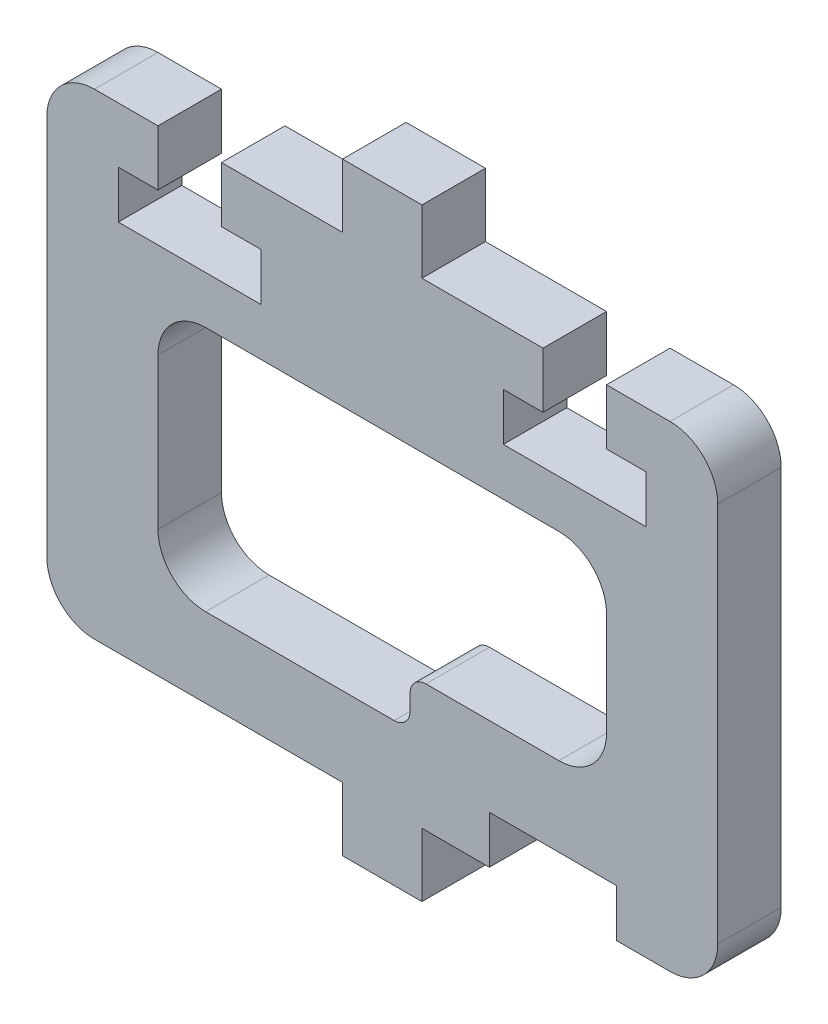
from build123d import *

# Parameters (mm, degrees)
SALIENTE_EXTRUIR1_DEPTH = 4
CORTAR_EXTRUIR1_DEPTH   = 4


with BuildPart() as part:
    # Croquis1 → Saliente-Extruir1 (new body)
    with BuildSketch(Plane.XY):
        with BuildLine():
            Line((-102.615102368, -94.221952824), (-98.365102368, -94.221952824))
            Line((-98.365102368, -94.221952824), (-98.365102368, -91.221952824))
            Line((-98.365102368, -91.221952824), (-90.365102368, -91.221952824))
            Line((-90.365102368, -91.221952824), (-90.365102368, -94.221952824))
            Line((-90.365102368, -94.221952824), (-86.990102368, -94.221952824))
            ThreePointArc((-86.990102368, -94.221952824), (-84.868782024, -93.343273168), (-83.990102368, -91.221952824))
            Line((-83.990102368, -91.221952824), (-83.990102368, -67.221952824))
            ThreePointArc((-83.990102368, -67.221952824), (-84.868782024, -65.10063248), (-86.990102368, -64.221952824))
            Line((-86.990102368, -64.221952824), (-90.990102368, -64.221952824))
            Line((-90.990102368, -64.221952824), (-90.990102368, -67.721952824))
            Line((-90.990102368, -67.721952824), (-88.490102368, -67.721952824))
            Line((-88.490102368, -67.721952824), (-88.490102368, -70.721952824))
            Line((-88.490102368, -70.721952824), (-97.490102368, -70.721952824))
            Line((-97.490102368, -70.721952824), (-97.490102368, -67.721952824))
            Line((-97.490102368, -67.721952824), (-94.990102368, -67.721952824))
            Line((-94.990102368, -67.721952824), (-94.990102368, -64.221952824))
            Line((-94.990102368, -64.221952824), (-102.615102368, -64.221952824))
            Line((-102.615102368, -64.221952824), (-102.615102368, -60.221952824))
            Line((-102.615102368, -60.221952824), (-105.115102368, -60.221952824))
            Line((-105.115102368, -60.221952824), (-107.615102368, -60.221952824))
            Line((-107.615102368, -60.221952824), (-107.615102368, -64.221952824))
            Line((-107.615102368, -64.221952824), (-115.240102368, -64.221952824))
            Line((-115.240102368, -64.221952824), (-115.240102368, -67.721952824))
            Line((-115.240102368, -67.721952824), (-112.740102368, -67.721952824))
            Line((-112.740102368, -67.721952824), (-112.740102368, -70.721952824))
            Line((-112.740102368, -70.721952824), (-121.740102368, -70.721952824))
            Line((-121.740102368, -70.721952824), (-121.740102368, -67.721952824))
            Line((-121.740102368, -67.721952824), (-119.240102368, -67.721952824))
            Line((-119.240102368, -67.721952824), (-119.240102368, -64.221952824))
            Line((-119.240102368, -64.221952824), (-123.240102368, -64.221952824))
            ThreePointArc((-123.240102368, -64.221952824), (-125.361422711, -65.10063248), (-126.240102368, -67.221952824))
            Line((-126.240102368, -67.221952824), (-126.240102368, -91.221952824))
            ThreePointArc((-126.240102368, -91.221952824), (-125.361422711, -93.343273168), (-123.240102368, -94.221952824))
            Line((-123.240102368, -94.221952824), (-107.615102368, -94.221952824))
            Line((-107.615102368, -94.221952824), (-107.615102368, -98.221952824))
            Line((-107.615102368, -98.221952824), (-105.115102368, -98.221952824))
            Line((-105.115102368, -98.221952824), (-102.615102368, -98.221952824))
            Line((-102.615102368, -98.221952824), (-102.615102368, -94.221952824))
        make_face()
    extrude(amount=SALIENTE_EXTRUIR1_DEPTH)

    # Croquis2 → Cortar-Extruir1 (cut)
    with BuildSketch(Plane.XY.offset(4)):
        with BuildLine():
            Line((-102.365102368, -86.221952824), (-93.990102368, -86.221952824))
            ThreePointArc((-93.990102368, -86.221952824), (-91.868782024, -85.343273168), (-90.990102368, -83.221952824))
            Line((-90.990102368, -83.221952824), (-90.990102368, -76.721952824))
            ThreePointArc((-90.990102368, -76.721952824), (-91.868782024, -74.60063248), (-93.990102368, -73.721952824))
            Line((-93.990102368, -73.721952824), (-116.240102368, -73.721952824))
            ThreePointArc((-116.240102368, -73.721952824), (-118.361422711, -74.60063248), (-119.240102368, -76.721952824))
            Line((-119.240102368, -76.721952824), (-119.240102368, -86.221952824))
            ThreePointArc((-119.240102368, -86.221952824), (-118.361422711, -88.343273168), (-116.240102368, -89.221952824))
            Line((-116.240102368, -89.221952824), (-104.365102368, -89.221952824))
            ThreePointArc((-104.365102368, -89.221952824), (-103.657995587, -88.929059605), (-103.365102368, -88.221952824))
            Line((-103.365102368, -88.221952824), (-103.365102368, -87.221952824))
            ThreePointArc((-103.365102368, -87.221952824), (-103.072209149, -86.514846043), (-102.365102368, -86.221952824))
        make_face()
    extrude(amount=-CORTAR_EXTRUIR1_DEPTH, mode=Mode.SUBTRACT)


solid = part.part
